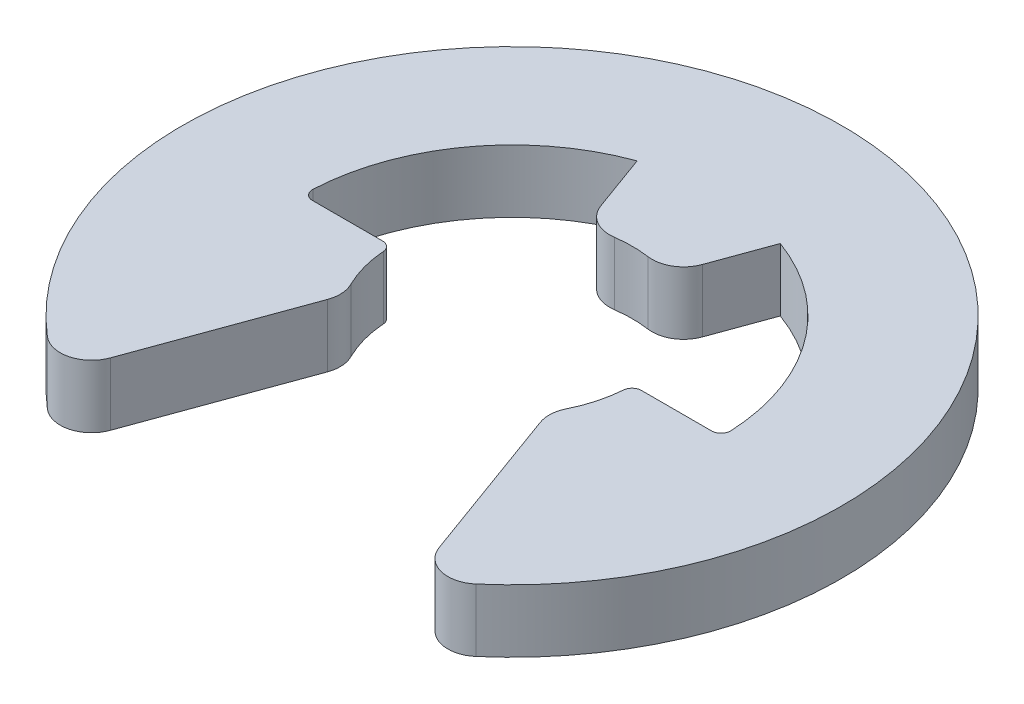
ISO-10303-21;
HEADER;
FILE_DESCRIPTION(('STEP AP214'),'2;1');
FILE_NAME('part.step','',(''),(''),'','','');
FILE_SCHEMA(('AUTOMOTIVE_DESIGN { 1 0 10303 214 1 1 1 1 }'));
ENDSEC;
DATA;
#1=APPLICATION_CONTEXT('core data for automotive mechanical design processes');
#2=APPLICATION_PROTOCOL_DEFINITION('international standard','automotive_design',2000,#1);
#3=PRODUCT_CONTEXT('',#1,'mechanical');
#4=PRODUCT('Part','Part','',(#3));
#5=PRODUCT_RELATED_PRODUCT_CATEGORY('part','',(#4));
#6=PRODUCT_DEFINITION_FORMATION('','',#4);
#7=PRODUCT_DEFINITION_CONTEXT('part definition',#1,'design');
#8=PRODUCT_DEFINITION('design','',#6,#7);
#9=PRODUCT_DEFINITION_SHAPE('','',#8);
#10=(LENGTH_UNIT() NAMED_UNIT(*) SI_UNIT(.MILLI.,.METRE.));
#11=(NAMED_UNIT(*) PLANE_ANGLE_UNIT() SI_UNIT($,.RADIAN.));
#12=(NAMED_UNIT(*) SI_UNIT($,.STERADIAN.) SOLID_ANGLE_UNIT());
#13=UNCERTAINTY_MEASURE_WITH_UNIT(LENGTH_MEASURE(1.E-05),#10,'distance_accuracy_value','');
#14=(GEOMETRIC_REPRESENTATION_CONTEXT(3) GLOBAL_UNCERTAINTY_ASSIGNED_CONTEXT((#13)) GLOBAL_UNIT_ASSIGNED_CONTEXT((#10,
#11,#12)) REPRESENTATION_CONTEXT('',''));
#15=CARTESIAN_POINT('',(0.,0.,0.));
#16=DIRECTION('',(0.,0.,1.));
#17=DIRECTION('',(1.,0.,0.));
#18=AXIS2_PLACEMENT_3D('',#15,#16,#17);
#19=CARTESIAN_POINT('',(0.,0.3,0.));
#20=DIRECTION('',(0.,-1.,0.));
#21=DIRECTION('',(0.,0.,-1.));
#22=AXIS2_PLACEMENT_3D('',#19,#20,#21);
#23=CYLINDRICAL_SURFACE('',#22,2.);
#24=CARTESIAN_POINT('',(0.,0.3,0.));
#25=DIRECTION('',(0.,-1.,0.));
#26=DIRECTION('',(0.,0.,1.));
#27=AXIS2_PLACEMENT_3D('',#24,#25,#26);
#28=CIRCLE('',#27,2.);
#29=CARTESIAN_POINT('',(-1.9977784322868,0.3,-0.0942408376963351));
#30=VERTEX_POINT('',#29);
#31=CARTESIAN_POINT('',(-0.684040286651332,0.3,-1.87938524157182));
#32=VERTEX_POINT('',#31);
#33=EDGE_CURVE('E187',#30,#32,#28,.T.);
#34=ORIENTED_EDGE('',*,*,#33,.F.);
#35=DIRECTION('',(0.,-1.,0.));
#36=VECTOR('',#35,1.);
#37=CARTESIAN_POINT('',(-1.9977784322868,0.3,-0.0942408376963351));
#38=LINE('',#37,#36);
#39=CARTESIAN_POINT('',(-1.9977784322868,-0.3,-0.0942408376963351));
#40=VERTEX_POINT('',#39);
#41=EDGE_CURVE('E327',#30,#40,#38,.T.);
#42=ORIENTED_EDGE('',*,*,#41,.T.);
#43=CARTESIAN_POINT('',(0.,-0.3,0.));
#44=DIRECTION('',(0.,-1.,0.));
#45=DIRECTION('',(0.,0.,1.));
#46=AXIS2_PLACEMENT_3D('',#43,#44,#45);
#47=CIRCLE('',#46,2.);
#48=CARTESIAN_POINT('',(-0.684040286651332,-0.3,-1.87938524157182));
#49=VERTEX_POINT('',#48);
#50=EDGE_CURVE('E211',#40,#49,#47,.T.);
#51=ORIENTED_EDGE('',*,*,#50,.T.);
#52=DIRECTION('',(0.,-1.,0.));
#53=VECTOR('',#52,1.);
#54=CARTESIAN_POINT('',(-0.684040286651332,0.3,-1.87938524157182));
#55=LINE('',#54,#53);
#56=EDGE_CURVE('E204',#32,#49,#55,.T.);
#57=ORIENTED_EDGE('',*,*,#56,.F.);
#58=EDGE_LOOP('',(#34,#42,#51,#57));
#59=FACE_BOUND('',#58,.T.);
#60=ADVANCED_FACE('F39',(#59),#23,.F.);
#61=CARTESIAN_POINT('',(-0.684040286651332,0.3,-1.87938524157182));
#62=DIRECTION('',(0.939692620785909,0.,-0.342020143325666));
#63=DIRECTION('',(-0.342020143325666,0.,-0.939692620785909));
#64=AXIS2_PLACEMENT_3D('',#61,#62,#63);
#65=PLANE('',#64);
#66=DIRECTION('',(0.342020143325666,0.,0.93969262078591));
#67=VECTOR('',#66,1.);
#68=CARTESIAN_POINT('',(-0.684040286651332,-0.3,-1.87938524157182));
#69=LINE('',#68,#67);
#70=CARTESIAN_POINT('',(-0.485198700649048,-0.3,-1.33307247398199));
#71=VERTEX_POINT('',#70);
#72=EDGE_CURVE('E446',#49,#71,#69,.T.);
#73=ORIENTED_EDGE('',*,*,#72,.T.);
#74=DIRECTION('',(0.,-1.,0.));
#75=VECTOR('',#74,1.);
#76=CARTESIAN_POINT('',(-0.485198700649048,0.3,-1.33307247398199));
#77=LINE('',#76,#75);
#78=CARTESIAN_POINT('',(-0.485198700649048,0.3,-1.33307247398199));
#79=VERTEX_POINT('',#78);
#80=EDGE_CURVE('E206',#71,#79,#77,.F.);
#81=ORIENTED_EDGE('',*,*,#80,.T.);
#82=DIRECTION('',(0.342020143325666,0.,0.93969262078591));
#83=VECTOR('',#82,1.);
#84=CARTESIAN_POINT('',(-0.684040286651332,0.3,-1.87938524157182));
#85=LINE('',#84,#83);
#86=EDGE_CURVE('E191',#32,#79,#85,.T.);
#87=ORIENTED_EDGE('',*,*,#86,.F.);
#88=ORIENTED_EDGE('',*,*,#56,.T.);
#89=EDGE_LOOP('',(#73,#81,#87,#88));
#90=FACE_BOUND('',#89,.T.);
#91=ADVANCED_FACE('F203',(#90),#65,.F.);
#92=CARTESIAN_POINT('',(0.,0.3,0.));
#93=DIRECTION('',(0.,-1.,0.));
#94=DIRECTION('',(0.,0.,-1.));
#95=AXIS2_PLACEMENT_3D('',#92,#93,#94);
#96=CYLINDRICAL_SURFACE('',#95,1.15);
#97=CARTESIAN_POINT('',(0.,-0.3,0.));
#98=DIRECTION('',(0.,-1.,0.));
#99=DIRECTION('',(0.,0.,1.));
#100=AXIS2_PLACEMENT_3D('',#97,#98,#99);
#101=CIRCLE('',#100,1.15);
#102=CARTESIAN_POINT('',(-0.161230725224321,-0.3,-1.13864158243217));
#103=VERTEX_POINT('',#102);
#104=CARTESIAN_POINT('',(0.161230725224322,-0.3,-1.13864158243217));
#105=VERTEX_POINT('',#104);
#106=EDGE_CURVE('E449',#103,#105,#101,.T.);
#107=ORIENTED_EDGE('',*,*,#106,.T.);
#108=DIRECTION('',(0.,-1.,0.));
#109=VECTOR('',#108,1.);
#110=CARTESIAN_POINT('',(0.161230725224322,0.3,-1.13864158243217));
#111=LINE('',#110,#109);
#112=CARTESIAN_POINT('',(0.161230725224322,0.3,-1.13864158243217));
#113=VERTEX_POINT('',#112);
#114=EDGE_CURVE('E290',#105,#113,#111,.F.);
#115=ORIENTED_EDGE('',*,*,#114,.T.);
#116=CARTESIAN_POINT('',(0.,0.3,0.));
#117=DIRECTION('',(0.,-1.,0.));
#118=DIRECTION('',(0.,0.,1.));
#119=AXIS2_PLACEMENT_3D('',#116,#117,#118);
#120=CIRCLE('',#119,1.15);
#121=CARTESIAN_POINT('',(-0.161230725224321,0.3,-1.13864158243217));
#122=VERTEX_POINT('',#121);
#123=EDGE_CURVE('E208',#122,#113,#120,.T.);
#124=ORIENTED_EDGE('',*,*,#123,.F.);
#125=DIRECTION('',(0.,-1.,0.));
#126=VECTOR('',#125,1.);
#127=CARTESIAN_POINT('',(-0.161230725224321,0.3,-1.13864158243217));
#128=LINE('',#127,#126);
#129=EDGE_CURVE('E286',#122,#103,#128,.T.);
#130=ORIENTED_EDGE('',*,*,#129,.T.);
#131=EDGE_LOOP('',(#107,#115,#124,#130));
#132=FACE_BOUND('',#131,.T.);
#133=ADVANCED_FACE('F370',(#132),#96,.F.);
#134=CARTESIAN_POINT('',(0.393323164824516,0.3,-1.0806465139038));
#135=DIRECTION('',(-0.939692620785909,0.,-0.342020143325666));
#136=DIRECTION('',(-0.342020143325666,0.,0.93969262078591));
#137=AXIS2_PLACEMENT_3D('',#134,#135,#136);
#138=PLANE('',#137);
#139=DIRECTION('',(0.342020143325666,0.,-0.939692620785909));
#140=VECTOR('',#139,1.);
#141=CARTESIAN_POINT('',(0.393323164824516,0.3,-1.0806465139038));
#142=LINE('',#141,#140);
#143=CARTESIAN_POINT('',(0.485198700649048,0.3,-1.33307247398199));
#144=VERTEX_POINT('',#143);
#145=CARTESIAN_POINT('',(0.684040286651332,0.3,-1.87938524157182));
#146=VERTEX_POINT('',#145);
#147=EDGE_CURVE('E424',#144,#146,#142,.T.);
#148=ORIENTED_EDGE('',*,*,#147,.F.);
#149=DIRECTION('',(0.,-1.,0.));
#150=VECTOR('',#149,1.);
#151=CARTESIAN_POINT('',(0.485198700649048,0.3,-1.33307247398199));
#152=LINE('',#151,#150);
#153=CARTESIAN_POINT('',(0.485198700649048,-0.3,-1.33307247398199));
#154=VERTEX_POINT('',#153);
#155=EDGE_CURVE('E282',#144,#154,#152,.T.);
#156=ORIENTED_EDGE('',*,*,#155,.T.);
#157=DIRECTION('',(0.342020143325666,0.,-0.939692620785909));
#158=VECTOR('',#157,1.);
#159=CARTESIAN_POINT('',(0.393323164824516,-0.3,-1.0806465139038));
#160=LINE('',#159,#158);
#161=CARTESIAN_POINT('',(0.684040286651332,-0.3,-1.87938524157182));
#162=VERTEX_POINT('',#161);
#163=EDGE_CURVE('E453',#154,#162,#160,.T.);
#164=ORIENTED_EDGE('',*,*,#163,.T.);
#165=DIRECTION('',(0.,-1.,0.));
#166=VECTOR('',#165,1.);
#167=CARTESIAN_POINT('',(0.684040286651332,0.3,-1.87938524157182));
#168=LINE('',#167,#166);
#169=EDGE_CURVE('E215',#146,#162,#168,.T.);
#170=ORIENTED_EDGE('',*,*,#169,.F.);
#171=EDGE_LOOP('',(#148,#156,#164,#170));
#172=FACE_BOUND('',#171,.T.);
#173=ADVANCED_FACE('F527',(#172),#138,.F.);
#174=CARTESIAN_POINT('',(0.,0.3,0.));
#175=DIRECTION('',(0.,-1.,0.));
#176=DIRECTION('',(0.,0.,-1.));
#177=AXIS2_PLACEMENT_3D('',#174,#175,#176);
#178=CYLINDRICAL_SURFACE('',#177,2.);
#179=CARTESIAN_POINT('',(0.,-0.3,0.));
#180=DIRECTION('',(0.,-1.,0.));
#181=DIRECTION('',(0.,0.,1.));
#182=AXIS2_PLACEMENT_3D('',#179,#180,#181);
#183=CIRCLE('',#182,2.);
#184=CARTESIAN_POINT('',(1.9977784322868,-0.3,-0.0942408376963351));
#185=VERTEX_POINT('',#184);
#186=EDGE_CURVE('E456',#162,#185,#183,.T.);
#187=ORIENTED_EDGE('',*,*,#186,.T.);
#188=DIRECTION('',(0.,-1.,0.));
#189=VECTOR('',#188,1.);
#190=CARTESIAN_POINT('',(1.9977784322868,0.3,-0.0942408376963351));
#191=LINE('',#190,#189);
#192=CARTESIAN_POINT('',(1.9977784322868,0.3,-0.0942408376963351));
#193=VERTEX_POINT('',#192);
#194=EDGE_CURVE('E309',#185,#193,#191,.F.);
#195=ORIENTED_EDGE('',*,*,#194,.T.);
#196=CARTESIAN_POINT('',(0.,0.3,0.));
#197=DIRECTION('',(0.,-1.,0.));
#198=DIRECTION('',(0.,0.,1.));
#199=AXIS2_PLACEMENT_3D('',#196,#197,#198);
#200=CIRCLE('',#199,2.);
#201=EDGE_CURVE('E410',#146,#193,#200,.T.);
#202=ORIENTED_EDGE('',*,*,#201,.F.);
#203=ORIENTED_EDGE('',*,*,#169,.T.);
#204=EDGE_LOOP('',(#187,#195,#202,#203));
#205=FACE_BOUND('',#204,.T.);
#206=ADVANCED_FACE('F521',(#205),#178,.F.);
#207=CARTESIAN_POINT('',(1.15,0.3,0.));
#208=DIRECTION('',(0.,0.,1.));
#209=DIRECTION('',(1.,0.,0.));
#210=AXIS2_PLACEMENT_3D('',#207,#208,#209);
#211=PLANE('',#210);
#212=DIRECTION('',(-1.,0.,0.));
#213=VECTOR('',#212,1.);
#214=CARTESIAN_POINT('',(1.15,0.3,0.));
#215=LINE('',#214,#213);
#216=CARTESIAN_POINT('',(1.90787840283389,0.3,0.));
#217=VERTEX_POINT('',#216);
#218=CARTESIAN_POINT('',(1.23672955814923,0.3,0.));
#219=VERTEX_POINT('',#218);
#220=EDGE_CURVE('E407',#217,#219,#215,.T.);
#221=ORIENTED_EDGE('',*,*,#220,.F.);
#222=DIRECTION('',(0.,1.,0.));
#223=VECTOR('',#222,1.);
#224=CARTESIAN_POINT('',(1.90787840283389,-0.3,0.));
#225=LINE('',#224,#223);
#226=CARTESIAN_POINT('',(1.90787840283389,-0.3,0.));
#227=VERTEX_POINT('',#226);
#228=EDGE_CURVE('E305',#217,#227,#225,.F.);
#229=ORIENTED_EDGE('',*,*,#228,.T.);
#230=DIRECTION('',(-1.,0.,0.));
#231=VECTOR('',#230,1.);
#232=CARTESIAN_POINT('',(1.15,-0.3,0.));
#233=LINE('',#232,#231);
#234=CARTESIAN_POINT('',(1.23672955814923,-0.3,0.));
#235=VERTEX_POINT('',#234);
#236=EDGE_CURVE('E460',#227,#235,#233,.T.);
#237=ORIENTED_EDGE('',*,*,#236,.T.);
#238=DIRECTION('',(0.,-1.,0.));
#239=VECTOR('',#238,1.);
#240=CARTESIAN_POINT('',(1.23672955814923,0.3,0.));
#241=LINE('',#240,#239);
#242=EDGE_CURVE('E302',#235,#219,#241,.F.);
#243=ORIENTED_EDGE('',*,*,#242,.T.);
#244=EDGE_LOOP('',(#221,#229,#237,#243));
#245=FACE_BOUND('',#244,.T.);
#246=ADVANCED_FACE('F412',(#245),#211,.F.);
#247=CARTESIAN_POINT('',(0.,0.3,0.));
#248=DIRECTION('',(0.,-1.,0.));
#249=DIRECTION('',(0.,0.,-1.));
#250=AXIS2_PLACEMENT_3D('',#247,#248,#249);
#251=CYLINDRICAL_SURFACE('',#250,1.15);
#252=CARTESIAN_POINT('',(0.,0.3,0.));
#253=DIRECTION('',(0.,-1.,0.));
#254=DIRECTION('',(0.,0.,1.));
#255=AXIS2_PLACEMENT_3D('',#252,#253,#254);
#256=CIRCLE('',#255,1.15);
#257=CARTESIAN_POINT('',(1.14696692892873,0.3,0.0834677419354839));
#258=VERTEX_POINT('',#257);
#259=CARTESIAN_POINT('',(1.0302022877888,0.3,0.511060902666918));
#260=VERTEX_POINT('',#259);
#261=EDGE_CURVE('E417',#258,#260,#256,.T.);
#262=ORIENTED_EDGE('',*,*,#261,.F.);
#263=DIRECTION('',(0.,-1.,0.));
#264=VECTOR('',#263,1.);
#265=CARTESIAN_POINT('',(1.14696692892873,0.3,0.0834677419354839));
#266=LINE('',#265,#264);
#267=CARTESIAN_POINT('',(1.14696692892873,-0.3,0.0834677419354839));
#268=VERTEX_POINT('',#267);
#269=EDGE_CURVE('E312',#258,#268,#266,.T.);
#270=ORIENTED_EDGE('',*,*,#269,.T.);
#271=CARTESIAN_POINT('',(0.,-0.3,0.));
#272=DIRECTION('',(0.,-1.,0.));
#273=DIRECTION('',(0.,0.,1.));
#274=AXIS2_PLACEMENT_3D('',#271,#272,#273);
#275=CIRCLE('',#274,1.15);
#276=CARTESIAN_POINT('',(1.0302022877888,-0.3,0.511060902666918));
#277=VERTEX_POINT('',#276);
#278=EDGE_CURVE('E463',#268,#277,#275,.T.);
#279=ORIENTED_EDGE('',*,*,#278,.T.);
#280=DIRECTION('',(0.,-1.,0.));
#281=VECTOR('',#280,1.);
#282=CARTESIAN_POINT('',(1.0302022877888,0.3,0.511060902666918));
#283=LINE('',#282,#281);
#284=EDGE_CURVE('E250',#277,#260,#283,.F.);
#285=ORIENTED_EDGE('',*,*,#284,.T.);
#286=EDGE_LOOP('',(#262,#270,#279,#285));
#287=FACE_BOUND('',#286,.T.);
#288=ADVANCED_FACE('F512',(#287),#251,.F.);
#289=CARTESIAN_POINT('',(0.969999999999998,0.3,0.617737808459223));
#290=DIRECTION('',(0.939692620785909,0.,-0.342020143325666));
#291=DIRECTION('',(-0.342020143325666,0.,-0.939692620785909));
#292=AXIS2_PLACEMENT_3D('',#289,#290,#291);
#293=PLANE('',#292);
#294=DIRECTION('',(0.342020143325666,0.,0.939692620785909));
#295=VECTOR('',#294,1.);
#296=CARTESIAN_POINT('',(0.969999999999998,0.3,0.617737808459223));
#297=LINE('',#296,#295);
#298=CARTESIAN_POINT('',(1.01704292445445,0.3,0.746987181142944));
#299=VERTEX_POINT('',#298);
#300=CARTESIAN_POINT('',(1.57074963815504,0.3,2.26828387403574));
#301=VERTEX_POINT('',#300);
#302=EDGE_CURVE('E421',#299,#301,#297,.T.);
#303=ORIENTED_EDGE('',*,*,#302,.F.);
#304=DIRECTION('',(0.,-1.,0.));
#305=VECTOR('',#304,1.);
#306=CARTESIAN_POINT('',(1.01704292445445,0.3,0.746987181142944));
#307=LINE('',#306,#305);
#308=CARTESIAN_POINT('',(1.01704292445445,-0.3,0.746987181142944));
#309=VERTEX_POINT('',#308);
#310=EDGE_CURVE('E220',#299,#309,#307,.T.);
#311=ORIENTED_EDGE('',*,*,#310,.T.);
#312=DIRECTION('',(0.342020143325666,0.,0.939692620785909));
#313=VECTOR('',#312,1.);
#314=CARTESIAN_POINT('',(0.969999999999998,-0.3,0.617737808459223));
#315=LINE('',#314,#313);
#316=CARTESIAN_POINT('',(1.57074963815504,-0.3,2.26828387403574));
#317=VERTEX_POINT('',#316);
#318=EDGE_CURVE('E466',#309,#317,#315,.T.);
#319=ORIENTED_EDGE('',*,*,#318,.T.);
#320=DIRECTION('',(0.,-1.,0.));
#321=VECTOR('',#320,1.);
#322=CARTESIAN_POINT('',(1.57074963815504,0.3,2.26828387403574));
#323=LINE('',#322,#321);
#324=EDGE_CURVE('E214',#317,#301,#323,.F.);
#325=ORIENTED_EDGE('',*,*,#324,.T.);
#326=EDGE_LOOP('',(#303,#311,#319,#325));
#327=FACE_BOUND('',#326,.T.);
#328=ADVANCED_FACE('F506',(#327),#293,.F.);
#329=CARTESIAN_POINT('',(0.,0.3,0.));
#330=DIRECTION('',(0.,-1.,0.));
#331=DIRECTION('',(0.,0.,-1.));
#332=AXIS2_PLACEMENT_3D('',#329,#330,#331);
#333=CYLINDRICAL_SURFACE('',#332,3.15);
#334=CARTESIAN_POINT('',(0.,0.3,0.));
#335=DIRECTION('',(0.,1.,0.));
#336=DIRECTION('',(0.,0.,1.));
#337=AXIS2_PLACEMENT_3D('',#334,#335,#336);
#338=CIRCLE('',#337,3.15);
#339=CARTESIAN_POINT('',(2.04767399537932,0.3,2.39364391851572));
#340=VERTEX_POINT('',#339);
#341=CARTESIAN_POINT('',(-2.04767399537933,0.3,2.39364391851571));
#342=VERTEX_POINT('',#341);
#343=EDGE_CURVE('E430',#340,#342,#338,.T.);
#344=ORIENTED_EDGE('',*,*,#343,.F.);
#345=DIRECTION('',(0.,-1.,0.));
#346=VECTOR('',#345,1.);
#347=CARTESIAN_POINT('',(2.04767399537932,0.3,2.39364391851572));
#348=LINE('',#347,#346);
#349=CARTESIAN_POINT('',(2.04767399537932,-0.3,2.39364391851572));
#350=VERTEX_POINT('',#349);
#351=EDGE_CURVE('E298',#340,#350,#348,.T.);
#352=ORIENTED_EDGE('',*,*,#351,.T.);
#353=CARTESIAN_POINT('',(0.,-0.3,0.));
#354=DIRECTION('',(0.,1.,0.));
#355=DIRECTION('',(0.,0.,1.));
#356=AXIS2_PLACEMENT_3D('',#353,#354,#355);
#357=CIRCLE('',#356,3.15);
#358=CARTESIAN_POINT('',(-2.04767399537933,-0.3,2.39364391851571));
#359=VERTEX_POINT('',#358);
#360=EDGE_CURVE('E470',#350,#359,#357,.T.);
#361=ORIENTED_EDGE('',*,*,#360,.T.);
#362=DIRECTION('',(0.,-1.,0.));
#363=VECTOR('',#362,1.);
#364=CARTESIAN_POINT('',(-2.04767399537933,0.3,2.39364391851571));
#365=LINE('',#364,#363);
#366=EDGE_CURVE('E295',#359,#342,#365,.F.);
#367=ORIENTED_EDGE('',*,*,#366,.T.);
#368=EDGE_LOOP('',(#344,#352,#361,#367));
#369=FACE_BOUND('',#368,.T.);
#370=ADVANCED_FACE('F499',(#369),#333,.T.);
#371=CARTESIAN_POINT('',(-1.70840216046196,0.3,2.64648107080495));
#372=DIRECTION('',(-0.939692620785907,0.,-0.342020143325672));
#373=DIRECTION('',(-0.342020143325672,0.,0.939692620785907));
#374=AXIS2_PLACEMENT_3D('',#371,#372,#373);
#375=PLANE('',#374);
#376=DIRECTION('',(0.342020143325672,0.,-0.939692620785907));
#377=VECTOR('',#376,1.);
#378=CARTESIAN_POINT('',(-1.70840216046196,-0.3,2.64648107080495));
#379=LINE('',#378,#377);
#380=CARTESIAN_POINT('',(-1.57074963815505,-0.3,2.26828387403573));
#381=VERTEX_POINT('',#380);
#382=CARTESIAN_POINT('',(-1.01704292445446,-0.3,0.746987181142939));
#383=VERTEX_POINT('',#382);
#384=EDGE_CURVE('E474',#381,#383,#379,.T.);
#385=ORIENTED_EDGE('',*,*,#384,.T.);
#386=DIRECTION('',(0.,-1.,0.));
#387=VECTOR('',#386,1.);
#388=CARTESIAN_POINT('',(-1.01704292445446,0.3,0.746987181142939));
#389=LINE('',#388,#387);
#390=CARTESIAN_POINT('',(-1.01704292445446,0.3,0.746987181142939));
#391=VERTEX_POINT('',#390);
#392=EDGE_CURVE('E279',#383,#391,#389,.F.);
#393=ORIENTED_EDGE('',*,*,#392,.T.);
#394=DIRECTION('',(0.342020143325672,0.,-0.939692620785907));
#395=VECTOR('',#394,1.);
#396=CARTESIAN_POINT('',(-1.70840216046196,0.3,2.64648107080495));
#397=LINE('',#396,#395);
#398=CARTESIAN_POINT('',(-1.57074963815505,0.3,2.26828387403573));
#399=VERTEX_POINT('',#398);
#400=EDGE_CURVE('E434',#399,#391,#397,.T.);
#401=ORIENTED_EDGE('',*,*,#400,.F.);
#402=DIRECTION('',(0.,-1.,0.));
#403=VECTOR('',#402,1.);
#404=CARTESIAN_POINT('',(-1.57074963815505,0.3,2.26828387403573));
#405=LINE('',#404,#403);
#406=EDGE_CURVE('E275',#399,#381,#405,.T.);
#407=ORIENTED_EDGE('',*,*,#406,.T.);
#408=EDGE_LOOP('',(#385,#393,#401,#407));
#409=FACE_BOUND('',#408,.T.);
#410=ADVANCED_FACE('F491',(#409),#375,.F.);
#411=CARTESIAN_POINT('',(0.,0.3,0.));
#412=DIRECTION('',(0.,-1.,0.));
#413=DIRECTION('',(0.,0.,-1.));
#414=AXIS2_PLACEMENT_3D('',#411,#412,#413);
#415=CYLINDRICAL_SURFACE('',#414,1.15);
#416=CARTESIAN_POINT('',(0.,-0.3,0.));
#417=DIRECTION('',(0.,-1.,0.));
#418=DIRECTION('',(0.,0.,1.));
#419=AXIS2_PLACEMENT_3D('',#416,#417,#418);
#420=CIRCLE('',#419,1.15);
#421=CARTESIAN_POINT('',(-1.0302022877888,-0.3,0.511060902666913));
#422=VERTEX_POINT('',#421);
#423=CARTESIAN_POINT('',(-1.14696692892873,-0.3,0.0834677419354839));
#424=VERTEX_POINT('',#423);
#425=EDGE_CURVE('E353',#422,#424,#420,.T.);
#426=ORIENTED_EDGE('',*,*,#425,.T.);
#427=DIRECTION('',(0.,-1.,0.));
#428=VECTOR('',#427,1.);
#429=CARTESIAN_POINT('',(-1.14696692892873,0.3,0.0834677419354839));
#430=LINE('',#429,#428);
#431=CARTESIAN_POINT('',(-1.14696692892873,0.3,0.0834677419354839));
#432=VERTEX_POINT('',#431);
#433=EDGE_CURVE('E336',#424,#432,#430,.F.);
#434=ORIENTED_EDGE('',*,*,#433,.T.);
#435=CARTESIAN_POINT('',(0.,0.3,0.));
#436=DIRECTION('',(0.,-1.,0.));
#437=DIRECTION('',(0.,0.,1.));
#438=AXIS2_PLACEMENT_3D('',#435,#436,#437);
#439=CIRCLE('',#438,1.15);
#440=CARTESIAN_POINT('',(-1.0302022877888,0.3,0.511060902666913));
#441=VERTEX_POINT('',#440);
#442=EDGE_CURVE('E438',#441,#432,#439,.T.);
#443=ORIENTED_EDGE('',*,*,#442,.F.);
#444=DIRECTION('',(0.,-1.,0.));
#445=VECTOR('',#444,1.);
#446=CARTESIAN_POINT('',(-1.0302022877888,0.3,0.511060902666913));
#447=LINE('',#446,#445);
#448=EDGE_CURVE('E271',#441,#422,#447,.T.);
#449=ORIENTED_EDGE('',*,*,#448,.T.);
#450=EDGE_LOOP('',(#426,#434,#443,#449));
#451=FACE_BOUND('',#450,.T.);
#452=ADVANCED_FACE('F483',(#451),#415,.F.);
#453=CARTESIAN_POINT('',(-1.15,0.3,0.));
#454=DIRECTION('',(0.,0.,1.));
#455=DIRECTION('',(1.,0.,0.));
#456=AXIS2_PLACEMENT_3D('',#453,#454,#455);
#457=PLANE('',#456);
#458=DIRECTION('',(-1.,0.,0.));
#459=VECTOR('',#458,1.);
#460=CARTESIAN_POINT('',(-1.15,-0.3,0.));
#461=LINE('',#460,#459);
#462=CARTESIAN_POINT('',(-1.23672955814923,-0.3,0.));
#463=VERTEX_POINT('',#462);
#464=CARTESIAN_POINT('',(-1.90787840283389,-0.3,0.));
#465=VERTEX_POINT('',#464);
#466=EDGE_CURVE('E198',#463,#465,#461,.T.);
#467=ORIENTED_EDGE('',*,*,#466,.T.);
#468=DIRECTION('',(0.,1.,0.));
#469=VECTOR('',#468,1.);
#470=CARTESIAN_POINT('',(-1.90787840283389,0.3,0.));
#471=LINE('',#470,#469);
#472=CARTESIAN_POINT('',(-1.90787840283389,0.3,0.));
#473=VERTEX_POINT('',#472);
#474=EDGE_CURVE('E61',#465,#473,#471,.T.);
#475=ORIENTED_EDGE('',*,*,#474,.T.);
#476=DIRECTION('',(-1.,0.,0.));
#477=VECTOR('',#476,1.);
#478=CARTESIAN_POINT('',(-1.15,0.3,0.));
#479=LINE('',#478,#477);
#480=CARTESIAN_POINT('',(-1.23672955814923,0.3,0.));
#481=VERTEX_POINT('',#480);
#482=EDGE_CURVE('E224',#481,#473,#479,.T.);
#483=ORIENTED_EDGE('',*,*,#482,.F.);
#484=DIRECTION('',(0.,-1.,0.));
#485=VECTOR('',#484,1.);
#486=CARTESIAN_POINT('',(-1.23672955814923,0.3,0.));
#487=LINE('',#486,#485);
#488=EDGE_CURVE('E330',#481,#463,#487,.T.);
#489=ORIENTED_EDGE('',*,*,#488,.T.);
#490=EDGE_LOOP('',(#467,#475,#483,#489));
#491=FACE_BOUND('',#490,.T.);
#492=ADVANCED_FACE('F350',(#491),#457,.F.);
#493=CARTESIAN_POINT('',(0.,0.3,0.));
#494=DIRECTION('',(0.,1.,0.));
#495=DIRECTION('',(0.,0.,1.));
#496=AXIS2_PLACEMENT_3D('',#493,#494,#495);
#497=PLANE('',#496);
#498=ORIENTED_EDGE('',*,*,#220,.T.);
#499=CARTESIAN_POINT('',(1.23672955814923,0.3,0.09));
#500=DIRECTION('',(0.,1.,0.));
#501=DIRECTION('',(0.,0.,1.));
#502=AXIS2_PLACEMENT_3D('',#499,#500,#501);
#503=CIRCLE('',#502,0.09);
#504=EDGE_CURVE('E324',#219,#258,#503,.T.);
#505=ORIENTED_EDGE('',*,*,#504,.T.);
#506=ORIENTED_EDGE('',*,*,#261,.T.);
#507=CARTESIAN_POINT('',(1.29895071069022,0.3,0.644381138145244));
#508=DIRECTION('',(0.,1.,0.));
#509=DIRECTION('',(0.,0.,1.));
#510=AXIS2_PLACEMENT_3D('',#507,#508,#509);
#511=CIRCLE('',#510,0.3);
#512=EDGE_CURVE('E268',#260,#299,#511,.T.);
#513=ORIENTED_EDGE('',*,*,#512,.T.);
#514=ORIENTED_EDGE('',*,*,#302,.T.);
#515=CARTESIAN_POINT('',(1.85265742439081,0.3,2.16567783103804));
#516=DIRECTION('',(0.,1.,0.));
#517=DIRECTION('',(0.,0.,1.));
#518=AXIS2_PLACEMENT_3D('',#515,#516,#517);
#519=CIRCLE('',#518,0.3);
#520=EDGE_CURVE('E256',#301,#340,#519,.T.);
#521=ORIENTED_EDGE('',*,*,#520,.T.);
#522=ORIENTED_EDGE('',*,*,#343,.T.);
#523=CARTESIAN_POINT('',(-1.85265742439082,0.3,2.16567783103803));
#524=DIRECTION('',(0.,1.,0.));
#525=DIRECTION('',(0.,0.,1.));
#526=AXIS2_PLACEMENT_3D('',#523,#524,#525);
#527=CIRCLE('',#526,0.3);
#528=EDGE_CURVE('E253',#342,#399,#527,.T.);
#529=ORIENTED_EDGE('',*,*,#528,.T.);
#530=ORIENTED_EDGE('',*,*,#400,.T.);
#531=CARTESIAN_POINT('',(-1.29895071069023,0.3,0.644381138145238));
#532=DIRECTION('',(0.,1.,0.));
#533=DIRECTION('',(0.,0.,1.));
#534=AXIS2_PLACEMENT_3D('',#531,#532,#533);
#535=CIRCLE('',#534,0.3);
#536=EDGE_CURVE('E265',#391,#441,#535,.T.);
#537=ORIENTED_EDGE('',*,*,#536,.T.);
#538=ORIENTED_EDGE('',*,*,#442,.T.);
#539=CARTESIAN_POINT('',(-1.23672955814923,0.3,0.09));
#540=DIRECTION('',(0.,1.,0.));
#541=DIRECTION('',(0.,0.,1.));
#542=AXIS2_PLACEMENT_3D('',#539,#540,#541);
#543=CIRCLE('',#542,0.09);
#544=EDGE_CURVE('E322',#432,#481,#543,.T.);
#545=ORIENTED_EDGE('',*,*,#544,.T.);
#546=ORIENTED_EDGE('',*,*,#482,.T.);
#547=CARTESIAN_POINT('',(-1.90787840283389,0.3,-0.09));
#548=DIRECTION('',(0.,1.,0.));
#549=DIRECTION('',(0.,0.,1.));
#550=AXIS2_PLACEMENT_3D('',#547,#548,#549);
#551=CIRCLE('',#550,0.09);
#552=EDGE_CURVE('E11',#473,#30,#551,.F.);
#553=ORIENTED_EDGE('',*,*,#552,.T.);
#554=ORIENTED_EDGE('',*,*,#33,.T.);
#555=ORIENTED_EDGE('',*,*,#86,.T.);
#556=CARTESIAN_POINT('',(-0.203290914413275,0.3,-1.43567851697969));
#557=DIRECTION('',(0.,1.,0.));
#558=DIRECTION('',(0.,0.,1.));
#559=AXIS2_PLACEMENT_3D('',#556,#557,#558);
#560=CIRCLE('',#559,0.3);
#561=EDGE_CURVE('E259',#79,#122,#560,.T.);
#562=ORIENTED_EDGE('',*,*,#561,.T.);
#563=ORIENTED_EDGE('',*,*,#123,.T.);
#564=CARTESIAN_POINT('',(0.203290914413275,0.3,-1.43567851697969));
#565=DIRECTION('',(0.,1.,0.));
#566=DIRECTION('',(0.,0.,1.));
#567=AXIS2_PLACEMENT_3D('',#564,#565,#566);
#568=CIRCLE('',#567,0.3);
#569=EDGE_CURVE('E262',#113,#144,#568,.T.);
#570=ORIENTED_EDGE('',*,*,#569,.T.);
#571=ORIENTED_EDGE('',*,*,#147,.T.);
#572=ORIENTED_EDGE('',*,*,#201,.T.);
#573=CARTESIAN_POINT('',(1.90787840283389,0.3,-0.09));
#574=DIRECTION('',(0.,1.,0.));
#575=DIRECTION('',(0.,0.,1.));
#576=AXIS2_PLACEMENT_3D('',#573,#574,#575);
#577=CIRCLE('',#576,0.09);
#578=EDGE_CURVE('E342',#193,#217,#577,.F.);
#579=ORIENTED_EDGE('',*,*,#578,.T.);
#580=EDGE_LOOP('',(#498,#505,#506,#513,#514,#521,#522,#529,#530,#537,#538,#545,#546,#553,#554,
#555,#562,#563,#570,#571,#572,#579));
#581=FACE_BOUND('',#580,.T.);
#582=ADVANCED_FACE('F190',(#581),#497,.T.);
#583=CARTESIAN_POINT('',(0.,-0.3,0.));
#584=DIRECTION('',(0.,1.,0.));
#585=DIRECTION('',(0.,0.,1.));
#586=AXIS2_PLACEMENT_3D('',#583,#584,#585);
#587=PLANE('',#586);
#588=ORIENTED_EDGE('',*,*,#278,.F.);
#589=CARTESIAN_POINT('',(1.23672955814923,-0.3,0.09));
#590=DIRECTION('',(0.,1.,0.));
#591=DIRECTION('',(0.,0.,1.));
#592=AXIS2_PLACEMENT_3D('',#589,#590,#591);
#593=CIRCLE('',#592,0.09);
#594=EDGE_CURVE('E319',#268,#235,#593,.F.);
#595=ORIENTED_EDGE('',*,*,#594,.T.);
#596=ORIENTED_EDGE('',*,*,#236,.F.);
#597=CARTESIAN_POINT('',(1.90787840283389,-0.3,-0.09));
#598=DIRECTION('',(0.,1.,0.));
#599=DIRECTION('',(0.,0.,1.));
#600=AXIS2_PLACEMENT_3D('',#597,#598,#599);
#601=CIRCLE('',#600,0.09);
#602=EDGE_CURVE('E339',#227,#185,#601,.T.);
#603=ORIENTED_EDGE('',*,*,#602,.T.);
#604=ORIENTED_EDGE('',*,*,#186,.F.);
#605=ORIENTED_EDGE('',*,*,#163,.F.);
#606=CARTESIAN_POINT('',(0.203290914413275,-0.3,-1.43567851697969));
#607=DIRECTION('',(0.,1.,0.));
#608=DIRECTION('',(0.,0.,1.));
#609=AXIS2_PLACEMENT_3D('',#606,#607,#608);
#610=CIRCLE('',#609,0.3);
#611=EDGE_CURVE('E240',#154,#105,#610,.F.);
#612=ORIENTED_EDGE('',*,*,#611,.T.);
#613=ORIENTED_EDGE('',*,*,#106,.F.);
#614=CARTESIAN_POINT('',(-0.203290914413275,-0.3,-1.43567851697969));
#615=DIRECTION('',(0.,1.,0.));
#616=DIRECTION('',(0.,0.,1.));
#617=AXIS2_PLACEMENT_3D('',#614,#615,#616);
#618=CIRCLE('',#617,0.3);
#619=EDGE_CURVE('E237',#103,#71,#618,.F.);
#620=ORIENTED_EDGE('',*,*,#619,.T.);
#621=ORIENTED_EDGE('',*,*,#72,.F.);
#622=ORIENTED_EDGE('',*,*,#50,.F.);
#623=CARTESIAN_POINT('',(-1.90787840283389,-0.3,-0.09));
#624=DIRECTION('',(0.,1.,0.));
#625=DIRECTION('',(0.,0.,1.));
#626=AXIS2_PLACEMENT_3D('',#623,#624,#625);
#627=CIRCLE('',#626,0.09);
#628=EDGE_CURVE('E48',#40,#465,#627,.T.);
#629=ORIENTED_EDGE('',*,*,#628,.T.);
#630=ORIENTED_EDGE('',*,*,#466,.F.);
#631=CARTESIAN_POINT('',(-1.23672955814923,-0.3,0.09));
#632=DIRECTION('',(0.,1.,0.));
#633=DIRECTION('',(0.,0.,1.));
#634=AXIS2_PLACEMENT_3D('',#631,#632,#633);
#635=CIRCLE('',#634,0.09);
#636=EDGE_CURVE('E316',#463,#424,#635,.F.);
#637=ORIENTED_EDGE('',*,*,#636,.T.);
#638=ORIENTED_EDGE('',*,*,#425,.F.);
#639=CARTESIAN_POINT('',(-1.29895071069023,-0.3,0.644381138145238));
#640=DIRECTION('',(0.,1.,0.));
#641=DIRECTION('',(0.,0.,1.));
#642=AXIS2_PLACEMENT_3D('',#639,#640,#641);
#643=CIRCLE('',#642,0.3);
#644=EDGE_CURVE('E243',#422,#383,#643,.F.);
#645=ORIENTED_EDGE('',*,*,#644,.T.);
#646=ORIENTED_EDGE('',*,*,#384,.F.);
#647=CARTESIAN_POINT('',(-1.85265742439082,-0.3,2.16567783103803));
#648=DIRECTION('',(0.,1.,0.));
#649=DIRECTION('',(0.,0.,1.));
#650=AXIS2_PLACEMENT_3D('',#647,#648,#649);
#651=CIRCLE('',#650,0.3);
#652=EDGE_CURVE('E231',#381,#359,#651,.F.);
#653=ORIENTED_EDGE('',*,*,#652,.T.);
#654=ORIENTED_EDGE('',*,*,#360,.F.);
#655=CARTESIAN_POINT('',(1.85265742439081,-0.3,2.16567783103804));
#656=DIRECTION('',(0.,1.,0.));
#657=DIRECTION('',(0.,0.,1.));
#658=AXIS2_PLACEMENT_3D('',#655,#656,#657);
#659=CIRCLE('',#658,0.3);
#660=EDGE_CURVE('E234',#350,#317,#659,.F.);
#661=ORIENTED_EDGE('',*,*,#660,.T.);
#662=ORIENTED_EDGE('',*,*,#318,.F.);
#663=CARTESIAN_POINT('',(1.29895071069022,-0.3,0.644381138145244));
#664=DIRECTION('',(0.,1.,0.));
#665=DIRECTION('',(0.,0.,1.));
#666=AXIS2_PLACEMENT_3D('',#663,#664,#665);
#667=CIRCLE('',#666,0.3);
#668=EDGE_CURVE('E246',#309,#277,#667,.F.);
#669=ORIENTED_EDGE('',*,*,#668,.T.);
#670=EDGE_LOOP('',(#588,#595,#596,#603,#604,#605,#612,#613,#620,#621,#622,#629,#630,#637,#638,
#645,#646,#653,#654,#661,#662,#669));
#671=FACE_BOUND('',#670,.T.);
#672=ADVANCED_FACE('F348',(#671),#587,.F.);
#673=CARTESIAN_POINT('',(1.29895071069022,0.3,0.644381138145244));
#674=DIRECTION('',(0.,-1.,0.));
#675=DIRECTION('',(0.,0.,-1.));
#676=AXIS2_PLACEMENT_3D('',#673,#674,#675);
#677=CYLINDRICAL_SURFACE('',#676,0.3);
#678=ORIENTED_EDGE('',*,*,#512,.F.);
#679=ORIENTED_EDGE('',*,*,#284,.F.);
#680=ORIENTED_EDGE('',*,*,#668,.F.);
#681=ORIENTED_EDGE('',*,*,#310,.F.);
#682=EDGE_LOOP('',(#678,#679,#680,#681));
#683=FACE_BOUND('',#682,.T.);
#684=ADVANCED_FACE('F374',(#683),#677,.T.);
#685=CARTESIAN_POINT('',(-1.29895071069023,0.3,0.644381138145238));
#686=DIRECTION('',(0.,-1.,0.));
#687=DIRECTION('',(0.,0.,-1.));
#688=AXIS2_PLACEMENT_3D('',#685,#686,#687);
#689=CYLINDRICAL_SURFACE('',#688,0.3);
#690=ORIENTED_EDGE('',*,*,#536,.F.);
#691=ORIENTED_EDGE('',*,*,#392,.F.);
#692=ORIENTED_EDGE('',*,*,#644,.F.);
#693=ORIENTED_EDGE('',*,*,#448,.F.);
#694=EDGE_LOOP('',(#690,#691,#692,#693));
#695=FACE_BOUND('',#694,.T.);
#696=ADVANCED_FACE('F377',(#695),#689,.T.);
#697=CARTESIAN_POINT('',(0.203290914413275,0.3,-1.43567851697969));
#698=DIRECTION('',(0.,-1.,0.));
#699=DIRECTION('',(0.,0.,-1.));
#700=AXIS2_PLACEMENT_3D('',#697,#698,#699);
#701=CYLINDRICAL_SURFACE('',#700,0.3);
#702=ORIENTED_EDGE('',*,*,#569,.F.);
#703=ORIENTED_EDGE('',*,*,#114,.F.);
#704=ORIENTED_EDGE('',*,*,#611,.F.);
#705=ORIENTED_EDGE('',*,*,#155,.F.);
#706=EDGE_LOOP('',(#702,#703,#704,#705));
#707=FACE_BOUND('',#706,.T.);
#708=ADVANCED_FACE('F381',(#707),#701,.T.);
#709=CARTESIAN_POINT('',(-0.203290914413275,0.3,-1.43567851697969));
#710=DIRECTION('',(0.,-1.,0.));
#711=DIRECTION('',(0.,0.,-1.));
#712=AXIS2_PLACEMENT_3D('',#709,#710,#711);
#713=CYLINDRICAL_SURFACE('',#712,0.3);
#714=ORIENTED_EDGE('',*,*,#561,.F.);
#715=ORIENTED_EDGE('',*,*,#80,.F.);
#716=ORIENTED_EDGE('',*,*,#619,.F.);
#717=ORIENTED_EDGE('',*,*,#129,.F.);
#718=EDGE_LOOP('',(#714,#715,#716,#717));
#719=FACE_BOUND('',#718,.T.);
#720=ADVANCED_FACE('F385',(#719),#713,.T.);
#721=CARTESIAN_POINT('',(1.85265742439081,0.3,2.16567783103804));
#722=DIRECTION('',(0.,-1.,0.));
#723=DIRECTION('',(0.,0.,-1.));
#724=AXIS2_PLACEMENT_3D('',#721,#722,#723);
#725=CYLINDRICAL_SURFACE('',#724,0.3);
#726=ORIENTED_EDGE('',*,*,#520,.F.);
#727=ORIENTED_EDGE('',*,*,#324,.F.);
#728=ORIENTED_EDGE('',*,*,#660,.F.);
#729=ORIENTED_EDGE('',*,*,#351,.F.);
#730=EDGE_LOOP('',(#726,#727,#728,#729));
#731=FACE_BOUND('',#730,.T.);
#732=ADVANCED_FACE('F389',(#731),#725,.T.);
#733=CARTESIAN_POINT('',(-1.85265742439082,0.3,2.16567783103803));
#734=DIRECTION('',(0.,-1.,0.));
#735=DIRECTION('',(0.,0.,-1.));
#736=AXIS2_PLACEMENT_3D('',#733,#734,#735);
#737=CYLINDRICAL_SURFACE('',#736,0.3);
#738=ORIENTED_EDGE('',*,*,#528,.F.);
#739=ORIENTED_EDGE('',*,*,#366,.F.);
#740=ORIENTED_EDGE('',*,*,#652,.F.);
#741=ORIENTED_EDGE('',*,*,#406,.F.);
#742=EDGE_LOOP('',(#738,#739,#740,#741));
#743=FACE_BOUND('',#742,.T.);
#744=ADVANCED_FACE('F393',(#743),#737,.T.);
#745=CARTESIAN_POINT('',(1.90787840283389,0.3,-0.09));
#746=DIRECTION('',(0.,-1.,0.));
#747=DIRECTION('',(0.,0.,-1.));
#748=AXIS2_PLACEMENT_3D('',#745,#746,#747);
#749=CYLINDRICAL_SURFACE('',#748,0.09);
#750=ORIENTED_EDGE('',*,*,#578,.F.);
#751=ORIENTED_EDGE('',*,*,#194,.F.);
#752=ORIENTED_EDGE('',*,*,#602,.F.);
#753=ORIENTED_EDGE('',*,*,#228,.F.);
#754=EDGE_LOOP('',(#750,#751,#752,#753));
#755=FACE_BOUND('',#754,.T.);
#756=ADVANCED_FACE('F362',(#755),#749,.F.);
#757=CARTESIAN_POINT('',(1.23672955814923,0.3,0.09));
#758=DIRECTION('',(0.,-1.,0.));
#759=DIRECTION('',(0.,0.,-1.));
#760=AXIS2_PLACEMENT_3D('',#757,#758,#759);
#761=CYLINDRICAL_SURFACE('',#760,0.09);
#762=ORIENTED_EDGE('',*,*,#504,.F.);
#763=ORIENTED_EDGE('',*,*,#242,.F.);
#764=ORIENTED_EDGE('',*,*,#594,.F.);
#765=ORIENTED_EDGE('',*,*,#269,.F.);
#766=EDGE_LOOP('',(#762,#763,#764,#765));
#767=FACE_BOUND('',#766,.T.);
#768=ADVANCED_FACE('F356',(#767),#761,.T.);
#769=CARTESIAN_POINT('',(-1.90787840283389,0.3,-0.09));
#770=DIRECTION('',(0.,-1.,0.));
#771=DIRECTION('',(0.,0.,-1.));
#772=AXIS2_PLACEMENT_3D('',#769,#770,#771);
#773=CYLINDRICAL_SURFACE('',#772,0.09);
#774=ORIENTED_EDGE('',*,*,#552,.F.);
#775=ORIENTED_EDGE('',*,*,#474,.F.);
#776=ORIENTED_EDGE('',*,*,#628,.F.);
#777=ORIENTED_EDGE('',*,*,#41,.F.);
#778=EDGE_LOOP('',(#774,#775,#776,#777));
#779=FACE_BOUND('',#778,.T.);
#780=ADVANCED_FACE('F354',(#779),#773,.F.);
#781=CARTESIAN_POINT('',(-1.23672955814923,0.3,0.09));
#782=DIRECTION('',(0.,-1.,0.));
#783=DIRECTION('',(0.,0.,-1.));
#784=AXIS2_PLACEMENT_3D('',#781,#782,#783);
#785=CYLINDRICAL_SURFACE('',#784,0.09);
#786=ORIENTED_EDGE('',*,*,#544,.F.);
#787=ORIENTED_EDGE('',*,*,#433,.F.);
#788=ORIENTED_EDGE('',*,*,#636,.F.);
#789=ORIENTED_EDGE('',*,*,#488,.F.);
#790=EDGE_LOOP('',(#786,#787,#788,#789));
#791=FACE_BOUND('',#790,.T.);
#792=ADVANCED_FACE('F41',(#791),#785,.T.);
#793=CLOSED_SHELL('',(#60,#91,#133,#173,#206,#246,#288,#328,#370,#410,#452,#492,#582,#672,#684,
#696,#708,#720,#732,#744,#756,#768,#780,#792));
#794=MANIFOLD_SOLID_BREP('B2',#793);
#795=ADVANCED_BREP_SHAPE_REPRESENTATION('',(#18,#794),#14);
#796=SHAPE_DEFINITION_REPRESENTATION(#9,#795);
ENDSEC;
END-ISO-10303-21;
